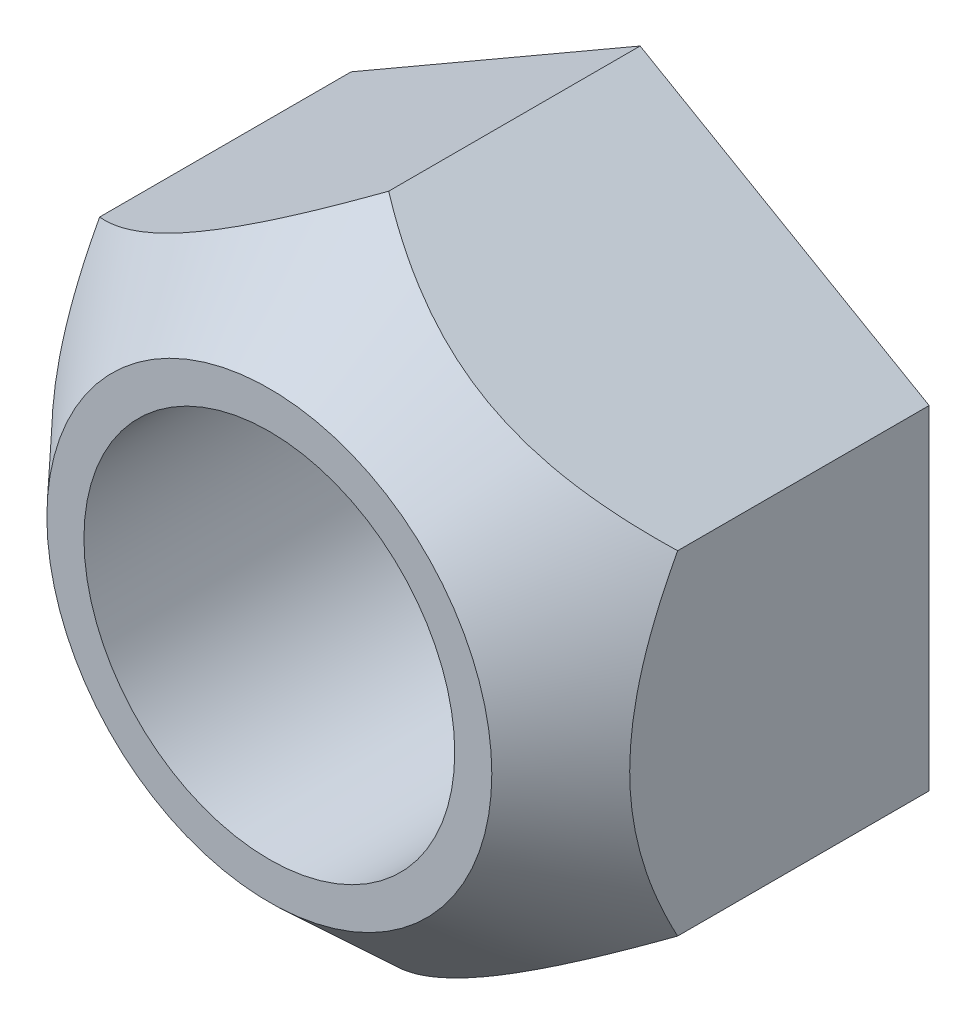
ISO-10303-21;
HEADER;
FILE_DESCRIPTION(('STEP AP214'),'2;1');
FILE_NAME('part.step','',(''),(''),'','','');
FILE_SCHEMA(('AUTOMOTIVE_DESIGN { 1 0 10303 214 1 1 1 1 }'));
ENDSEC;
DATA;
#1=APPLICATION_CONTEXT('core data for automotive mechanical design processes');
#2=APPLICATION_PROTOCOL_DEFINITION('international standard','automotive_design',2000,#1);
#3=PRODUCT_CONTEXT('',#1,'mechanical');
#4=PRODUCT('Part','Part','',(#3));
#5=PRODUCT_RELATED_PRODUCT_CATEGORY('part','',(#4));
#6=PRODUCT_DEFINITION_FORMATION('','',#4);
#7=PRODUCT_DEFINITION_CONTEXT('part definition',#1,'design');
#8=PRODUCT_DEFINITION('design','',#6,#7);
#9=PRODUCT_DEFINITION_SHAPE('','',#8);
#10=(LENGTH_UNIT() NAMED_UNIT(*) SI_UNIT(.MILLI.,.METRE.));
#11=(NAMED_UNIT(*) PLANE_ANGLE_UNIT() SI_UNIT($,.RADIAN.));
#12=(NAMED_UNIT(*) SI_UNIT($,.STERADIAN.) SOLID_ANGLE_UNIT());
#13=UNCERTAINTY_MEASURE_WITH_UNIT(LENGTH_MEASURE(1.E-05),#10,'distance_accuracy_value','');
#14=(GEOMETRIC_REPRESENTATION_CONTEXT(3) GLOBAL_UNCERTAINTY_ASSIGNED_CONTEXT((#13)) GLOBAL_UNIT_ASSIGNED_CONTEXT((#10,
#11,#12)) REPRESENTATION_CONTEXT('',''));
#15=CARTESIAN_POINT('',(0.,0.,0.));
#16=DIRECTION('',(0.,0.,1.));
#17=DIRECTION('',(1.,0.,0.));
#18=AXIS2_PLACEMENT_3D('',#15,#16,#17);
#19=CARTESIAN_POINT('',(-3.89711431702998,-2.25000000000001,-5.));
#20=DIRECTION('',(-0.5,-0.866025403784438,0.));
#21=DIRECTION('',(0.866025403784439,-0.5,0.));
#22=AXIS2_PLACEMENT_3D('',#19,#20,#21);
#23=PLANE('',#22);
#24=DIRECTION('',(0.,0.,1.));
#25=VECTOR('',#24,1.);
#26=CARTESIAN_POINT('',(0.,-4.5,-5.));
#27=LINE('',#26,#25);
#28=CARTESIAN_POINT('',(0.,-4.5,-5.));
#29=VERTEX_POINT('',#28);
#30=CARTESIAN_POINT('',(0.,-4.5,-1.60855306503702));
#31=VERTEX_POINT('',#30);
#32=EDGE_CURVE('E32',#29,#31,#27,.T.);
#33=ORIENTED_EDGE('',*,*,#32,.T.);
#34=CARTESIAN_POINT('',(0.000199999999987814,-4.50011547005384,-1.60867689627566));
#35=CARTESIAN_POINT('',(-0.0629287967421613,-4.46366804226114,-1.5695954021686));
#36=CARTESIAN_POINT('',(-0.1265655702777,-4.42692733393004,-1.53161049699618));
#37=CARTESIAN_POINT('',(-0.254961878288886,-4.35279769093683,-1.4581651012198));
#38=CARTESIAN_POINT('',(-0.319721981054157,-4.31540842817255,-1.42270593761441));
#39=CARTESIAN_POINT('',(-0.516487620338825,-4.20180573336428,-1.32028924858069));
#40=CARTESIAN_POINT('',(-0.650265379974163,-4.12456910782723,-1.2577432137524));
#41=CARTESIAN_POINT('',(-0.920543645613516,-3.96852387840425,-1.14878573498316));
#42=CARTESIAN_POINT('',(-1.05697565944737,-3.88975481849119,-1.10215157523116));
#43=CARTESIAN_POINT('',(-1.33339518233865,-3.73016393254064,-1.02762893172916));
#44=CARTESIAN_POINT('',(-1.47337255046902,-3.64934796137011,-0.9996921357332));
#45=CARTESIAN_POINT('',(-1.71070596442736,-3.51232345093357,-0.970711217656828));
#46=CARTESIAN_POINT('',(-1.80755347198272,-3.45640851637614,-0.963958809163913));
#47=CARTESIAN_POINT('',(-2.00141310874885,-3.34448360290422,-0.960828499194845));
#48=CARTESIAN_POINT('',(-2.0984252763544,-3.28847360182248,-0.964453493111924));
#49=CARTESIAN_POINT('',(-2.29184008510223,-3.17680550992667,-0.981898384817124));
#50=CARTESIAN_POINT('',(-2.38824205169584,-3.12114780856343,-0.995728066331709));
#51=CARTESIAN_POINT('',(-2.57964059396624,-3.01064380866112,-1.03285806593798));
#52=CARTESIAN_POINT('',(-2.67463727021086,-2.95579745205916,-1.05615770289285));
#53=CARTESIAN_POINT('',(-2.86728043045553,-2.84457487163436,-1.11248331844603));
#54=CARTESIAN_POINT('',(-2.96483528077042,-2.78825155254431,-1.14592242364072));
#55=CARTESIAN_POINT('',(-3.15768355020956,-2.67691055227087,-1.22068978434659));
#56=CARTESIAN_POINT('',(-3.25297569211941,-2.62189360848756,-1.26202238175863));
#57=CARTESIAN_POINT('',(-3.4411497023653,-2.5132512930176,-1.35121680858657));
#58=CARTESIAN_POINT('',(-3.53403288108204,-2.4596251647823,-1.39907499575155));
#59=CARTESIAN_POINT('',(-3.71739831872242,-2.35375908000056,-1.50013602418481));
#60=CARTESIAN_POINT('',(-3.80788455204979,-2.30151682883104,-1.55332921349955));
#61=CARTESIAN_POINT('',(-3.89731431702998,-2.24988452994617,-1.60867689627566));
#62=B_SPLINE_CURVE_WITH_KNOTS('',3,(#34,#35,#36,#37,#38,#39,#40,#41,#42,#43,#44,#45,#46,#47,#48,
#49,#50,#51,#52,#53,#54,#55,#56,#57,#58,#59,#60,#61),.UNSPECIFIED.,.F.,.F.,(4,2,2,2,2,2,2,2,2,2,
2,2,2,4),(0.,0.248113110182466,0.496355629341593,0.995650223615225,1.48763825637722,
1.97835007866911,2.31400450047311,2.64975258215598,2.98582298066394,3.32186921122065,
3.67404317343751,4.02641141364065,4.37858377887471,4.73013011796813),.UNSPECIFIED.);
#63=CARTESIAN_POINT('',(-3.89711431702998,-2.25000000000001,-1.60855306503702));
#64=VERTEX_POINT('',#63);
#65=EDGE_CURVE('E45',#31,#64,#62,.T.);
#66=ORIENTED_EDGE('',*,*,#65,.T.);
#67=DIRECTION('',(0.,0.,1.));
#68=VECTOR('',#67,1.);
#69=CARTESIAN_POINT('',(-3.89711431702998,-2.25000000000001,-5.));
#70=LINE('',#69,#68);
#71=CARTESIAN_POINT('',(-3.89711431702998,-2.25000000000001,-5.));
#72=VERTEX_POINT('',#71);
#73=EDGE_CURVE('E11',#72,#64,#70,.T.);
#74=ORIENTED_EDGE('',*,*,#73,.F.);
#75=DIRECTION('',(0.866025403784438,-0.5,0.));
#76=VECTOR('',#75,1.);
#77=CARTESIAN_POINT('',(-3.89711431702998,-2.25000000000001,-5.));
#78=LINE('',#77,#76);
#79=EDGE_CURVE('E122',#72,#29,#78,.T.);
#80=ORIENTED_EDGE('',*,*,#79,.T.);
#81=EDGE_LOOP('',(#33,#66,#74,#80));
#82=FACE_BOUND('',#81,.T.);
#83=ADVANCED_FACE('F28',(#82),#23,.T.);
#84=CARTESIAN_POINT('',(-3.89711431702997,2.25,-5.));
#85=DIRECTION('',(-1.,0.,0.));
#86=DIRECTION('',(0.,-1.,0.));
#87=AXIS2_PLACEMENT_3D('',#84,#85,#86);
#88=PLANE('',#87);
#89=ORIENTED_EDGE('',*,*,#73,.T.);
#90=CARTESIAN_POINT('',(-3.89711431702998,-5.21260992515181,-3.76225979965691));
#91=CARTESIAN_POINT('',(-3.89711431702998,-5.09064696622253,-3.65753177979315));
#92=CARTESIAN_POINT('',(-3.89711431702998,-4.96804870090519,-3.55353314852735));
#93=CARTESIAN_POINT('',(-3.89711431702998,-4.72129985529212,-3.34734277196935));
#94=CARTESIAN_POINT('',(-3.89711431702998,-4.59714895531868,-3.24515140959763));
#95=CARTESIAN_POINT('',(-3.89711431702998,-4.34609001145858,-3.04218041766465));
#96=CARTESIAN_POINT('',(-3.89711431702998,-4.21916802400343,-2.94141798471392));
#97=CARTESIAN_POINT('',(-3.89711431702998,-3.96318804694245,-2.74265578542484));
#98=CARTESIAN_POINT('',(-3.89711431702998,-3.83413020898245,-2.64465582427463));
#99=CARTESIAN_POINT('',(-3.89711431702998,-3.56329479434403,-2.4445727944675));
#100=CARTESIAN_POINT('',(-3.89711431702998,-3.4213106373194,-2.34276803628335));
#101=CARTESIAN_POINT('',(-3.89711431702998,-3.13374233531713,-2.14427870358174));
#102=CARTESIAN_POINT('',(-3.89711431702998,-2.98815745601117,-2.04759518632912));
#103=CARTESIAN_POINT('',(-3.89711431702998,-2.69316188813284,-1.86126461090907));
#104=CARTESIAN_POINT('',(-3.89711431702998,-2.54376468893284,-1.7715963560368));
#105=CARTESIAN_POINT('',(-3.89711431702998,-2.2399950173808,-1.60119859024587));
#106=CARTESIAN_POINT('',(-3.89711431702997,-2.08562532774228,-1.52046418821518));
#107=CARTESIAN_POINT('',(-3.89711431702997,-1.79851600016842,-1.38392161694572));
#108=CARTESIAN_POINT('',(-3.89711431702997,-1.66668449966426,-1.3262204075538));
#109=CARTESIAN_POINT('',(-3.89711431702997,-1.39889230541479,-1.22111213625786));
#110=CARTESIAN_POINT('',(-3.89711431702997,-1.2629309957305,-1.17370661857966));
#111=CARTESIAN_POINT('',(-3.89711431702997,-0.989539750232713,-1.0923967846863));
#112=CARTESIAN_POINT('',(-3.89711431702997,-0.852176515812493,-1.05827193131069));
#113=CARTESIAN_POINT('',(-3.89711431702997,-0.574610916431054,-1.00469116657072));
#114=CARTESIAN_POINT('',(-3.89711431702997,-0.434410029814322,-0.98522780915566));
#115=CARTESIAN_POINT('',(-3.89711431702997,-0.182530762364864,-0.964929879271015));
#116=CARTESIAN_POINT('',(-3.89711431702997,-0.0710949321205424,-0.961024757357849));
#117=CARTESIAN_POINT('',(-3.89711431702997,0.151653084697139,-0.963496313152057));
#118=CARTESIAN_POINT('',(-3.89711431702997,0.262965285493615,-0.969871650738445));
#119=CARTESIAN_POINT('',(-3.89711431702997,0.484978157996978,-0.99259863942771));
#120=CARTESIAN_POINT('',(-3.89711431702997,0.595674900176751,-1.00898809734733));
#121=CARTESIAN_POINT('',(-3.89711431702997,0.815311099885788,-1.05094016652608));
#122=CARTESIAN_POINT('',(-3.89711431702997,0.924250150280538,-1.07650487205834));
#123=CARTESIAN_POINT('',(-3.89711431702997,1.190445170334,-1.14958489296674));
#124=CARTESIAN_POINT('',(-3.89711431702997,1.34641756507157,-1.20177248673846));
#125=CARTESIAN_POINT('',(-3.89711431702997,1.65305814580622,-1.31985773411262));
#126=CARTESIAN_POINT('',(-3.89711431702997,1.80372272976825,-1.3857644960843));
#127=CARTESIAN_POINT('',(-3.89711431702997,2.10171060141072,-1.52886495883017));
#128=CARTESIAN_POINT('',(-3.89711431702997,2.24897414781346,-1.60618172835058));
#129=CARTESIAN_POINT('',(-3.89711431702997,2.46637771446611,-1.72821395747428));
#130=CARTESIAN_POINT('',(-3.89711431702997,2.53825354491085,-1.76989446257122));
#131=CARTESIAN_POINT('',(-3.89711431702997,2.68094249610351,-1.85503230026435));
#132=CARTESIAN_POINT('',(-3.89711431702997,2.75175566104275,-1.89848955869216));
#133=CARTESIAN_POINT('',(-3.89711431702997,2.97889443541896,-2.0413446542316));
#134=CARTESIAN_POINT('',(-3.89711431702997,3.13328957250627,-2.14381582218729));
#135=CARTESIAN_POINT('',(-3.89711431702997,3.43811147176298,-2.35452302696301));
#136=CARTESIAN_POINT('',(-3.89711431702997,3.58853720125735,-2.46276054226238));
#137=CARTESIAN_POINT('',(-3.89711431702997,3.88624750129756,-2.68373576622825));
#138=CARTESIAN_POINT('',(-3.89711431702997,4.03352907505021,-2.79647749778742));
#139=CARTESIAN_POINT('',(-3.89711431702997,4.32537884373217,-3.02537941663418));
#140=CARTESIAN_POINT('',(-3.89711431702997,4.46994728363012,-3.14153929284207));
#141=CARTESIAN_POINT('',(-3.89711431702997,4.75745725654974,-3.37706841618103));
#142=CARTESIAN_POINT('',(-3.89711431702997,4.90038939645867,-3.49644910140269));
#143=CARTESIAN_POINT('',(-3.89711431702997,5.18438275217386,-3.73741844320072));
#144=CARTESIAN_POINT('',(-3.89711431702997,5.32544391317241,-3.8590071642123));
#145=CARTESIAN_POINT('',(-3.89711431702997,5.74614216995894,-4.22632254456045));
#146=CARTESIAN_POINT('',(-3.89711431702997,6.02344419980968,-4.47472294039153));
#147=CARTESIAN_POINT('',(-3.89711431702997,6.54376688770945,-4.94923781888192));
#148=CARTESIAN_POINT('',(-3.89711431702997,6.7872471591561,-5.17485165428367));
#149=CARTESIAN_POINT('',(-3.89711431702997,7.27150515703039,-5.62902599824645));
#150=CARTESIAN_POINT('',(-3.89711431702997,7.51228250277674,-5.85758691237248));
#151=CARTESIAN_POINT('',(-3.89711431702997,7.98963345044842,-6.31493820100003));
#152=CARTESIAN_POINT('',(-3.89711431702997,8.22622539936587,-6.54370946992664));
#153=CARTESIAN_POINT('',(-3.89711431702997,8.69767558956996,-7.00294130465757));
#154=CARTESIAN_POINT('',(-3.89711431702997,8.93253415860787,-7.23340153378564));
#155=CARTESIAN_POINT('',(-3.89711431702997,9.1667512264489,-7.46450597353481));
#156=B_SPLINE_CURVE_WITH_KNOTS('',3,(#90,#91,#92,#93,#94,#95,#96,#97,#98,#99,#100,#101,#102,
#103,#104,#105,#106,#107,#108,#109,#110,#111,#112,#113,#114,#115,#116,#117,#118,#119,#120,#121,
#122,#123,#124,#125,#126,#127,#128,#129,#130,#131,#132,#133,#134,#135,#136,#137,#138,#139,#140,
#141,#142,#143,#144,#145,#146,#147,#148,#149,#150,#151,#152,#153,#154,#155),.UNSPECIFIED.,.F.,
.F.,(4,2,2,2,2,2,2,2,2,2,2,2,2,2,2,2,2,2,2,2,2,2,2,2,2,2,2,2,2,2,2,2,4),(0.,0.482279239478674,
0.964659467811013,1.45079708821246,1.93690033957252,2.46094397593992,2.98509538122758,
3.5075964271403,4.02980998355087,4.4611898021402,4.89263427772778,5.31657275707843,
5.740295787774,6.0743524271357,6.40836552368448,6.74364749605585,7.07900604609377,
7.57153479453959,8.06439158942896,8.56301650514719,8.81225742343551,9.06148794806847,
9.61720889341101,10.1730730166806,10.7294452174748,11.2857669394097,11.8444271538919,
12.4031036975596,13.51987176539,14.5156672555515,15.5116012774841,16.4989158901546,
17.4860387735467),.UNSPECIFIED.);
#157=CARTESIAN_POINT('',(-3.89711431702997,2.25,-1.60855306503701));
#158=VERTEX_POINT('',#157);
#159=EDGE_CURVE('E135',#64,#158,#156,.T.);
#160=ORIENTED_EDGE('',*,*,#159,.T.);
#161=DIRECTION('',(0.,0.,1.));
#162=VECTOR('',#161,1.);
#163=CARTESIAN_POINT('',(-3.89711431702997,2.25,-5.));
#164=LINE('',#163,#162);
#165=CARTESIAN_POINT('',(-3.89711431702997,2.25,-5.));
#166=VERTEX_POINT('',#165);
#167=EDGE_CURVE('E37',#166,#158,#164,.T.);
#168=ORIENTED_EDGE('',*,*,#167,.F.);
#169=DIRECTION('',(0.,-1.,0.));
#170=VECTOR('',#169,1.);
#171=CARTESIAN_POINT('',(-3.89711431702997,2.25,-5.));
#172=LINE('',#171,#170);
#173=EDGE_CURVE('E105',#166,#72,#172,.T.);
#174=ORIENTED_EDGE('',*,*,#173,.T.);
#175=EDGE_LOOP('',(#89,#160,#168,#174));
#176=FACE_BOUND('',#175,.T.);
#177=ADVANCED_FACE('F174',(#176),#88,.T.);
#178=CARTESIAN_POINT('',(0.,4.5,-5.));
#179=DIRECTION('',(-0.500000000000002,0.866025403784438,0.));
#180=DIRECTION('',(-0.866025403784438,-0.500000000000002,0.));
#181=AXIS2_PLACEMENT_3D('',#178,#179,#180);
#182=PLANE('',#181);
#183=ORIENTED_EDGE('',*,*,#167,.T.);
#184=CARTESIAN_POINT('',(-3.89731431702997,2.24988452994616,-1.60867689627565));
#185=CARTESIAN_POINT('',(-3.83418552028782,2.28633195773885,-1.56959540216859));
#186=CARTESIAN_POINT('',(-3.77054874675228,2.32307266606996,-1.53161049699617));
#187=CARTESIAN_POINT('',(-3.6421524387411,2.39720230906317,-1.45816510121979));
#188=CARTESIAN_POINT('',(-3.57739233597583,2.43459157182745,-1.4227059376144));
#189=CARTESIAN_POINT('',(-3.38062669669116,2.54819426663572,-1.32028924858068));
#190=CARTESIAN_POINT('',(-3.24684893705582,2.62543089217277,-1.25774321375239));
#191=CARTESIAN_POINT('',(-2.97657067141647,2.78147612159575,-1.14878573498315));
#192=CARTESIAN_POINT('',(-2.84013865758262,2.86024518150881,-1.10215157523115));
#193=CARTESIAN_POINT('',(-2.56371913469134,3.01983606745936,-1.02762893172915));
#194=CARTESIAN_POINT('',(-2.42374176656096,3.10065203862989,-0.99969213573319));
#195=CARTESIAN_POINT('',(-2.18640835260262,3.23767654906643,-0.970711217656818));
#196=CARTESIAN_POINT('',(-2.08956084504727,3.29359148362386,-0.963958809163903));
#197=CARTESIAN_POINT('',(-1.89570120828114,3.40551639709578,-0.960828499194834));
#198=CARTESIAN_POINT('',(-1.79868904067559,3.46152639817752,-0.964453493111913));
#199=CARTESIAN_POINT('',(-1.60527423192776,3.57319449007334,-0.981898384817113));
#200=CARTESIAN_POINT('',(-1.50887226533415,3.62885219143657,-0.995728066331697));
#201=CARTESIAN_POINT('',(-1.31747372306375,3.73935619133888,-1.03285806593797));
#202=CARTESIAN_POINT('',(-1.22247704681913,3.79420254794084,-1.05615770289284));
#203=CARTESIAN_POINT('',(-1.02983388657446,3.90542512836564,-1.11248331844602));
#204=CARTESIAN_POINT('',(-0.932279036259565,3.9617484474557,-1.14592242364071));
#205=CARTESIAN_POINT('',(-0.739430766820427,4.07308944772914,-1.22068978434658));
#206=CARTESIAN_POINT('',(-0.644138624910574,4.12810639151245,-1.26202238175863));
#207=CARTESIAN_POINT('',(-0.455964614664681,4.23674870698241,-1.35121680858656));
#208=CARTESIAN_POINT('',(-0.363081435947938,4.29037483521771,-1.39907499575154));
#209=CARTESIAN_POINT('',(-0.179715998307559,4.39624091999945,-1.50013602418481));
#210=CARTESIAN_POINT('',(-0.0892297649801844,4.44848317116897,-1.55332921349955));
#211=CARTESIAN_POINT('',(0.000199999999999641,4.50011547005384,-1.60867689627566));
#212=B_SPLINE_CURVE_WITH_KNOTS('',3,(#184,#185,#186,#187,#188,#189,#190,#191,#192,#193,#194,
#195,#196,#197,#198,#199,#200,#201,#202,#203,#204,#205,#206,#207,#208,#209,#210,#211),
.UNSPECIFIED.,.F.,.F.,(4,2,2,2,2,2,2,2,2,2,2,2,2,4),(0.,0.248113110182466,0.496355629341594,
0.995650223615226,1.48763825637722,1.97835007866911,2.31400450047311,2.64975258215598,
2.98582298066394,3.32186921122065,3.67404317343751,4.02641141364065,4.37858377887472,
4.73013011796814),.UNSPECIFIED.);
#213=CARTESIAN_POINT('',(0.,4.5,-1.60855306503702));
#214=VERTEX_POINT('',#213);
#215=EDGE_CURVE('E164',#158,#214,#212,.T.);
#216=ORIENTED_EDGE('',*,*,#215,.T.);
#217=DIRECTION('',(0.,0.,1.));
#218=VECTOR('',#217,1.);
#219=CARTESIAN_POINT('',(0.,4.5,-5.));
#220=LINE('',#219,#218);
#221=CARTESIAN_POINT('',(0.,4.5,-5.));
#222=VERTEX_POINT('',#221);
#223=EDGE_CURVE('E103',#222,#214,#220,.T.);
#224=ORIENTED_EDGE('',*,*,#223,.F.);
#225=DIRECTION('',(-0.866025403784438,-0.500000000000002,0.));
#226=VECTOR('',#225,1.);
#227=CARTESIAN_POINT('',(0.,4.5,-5.));
#228=LINE('',#227,#226);
#229=EDGE_CURVE('E113',#222,#166,#228,.T.);
#230=ORIENTED_EDGE('',*,*,#229,.T.);
#231=EDGE_LOOP('',(#183,#216,#224,#230));
#232=FACE_BOUND('',#231,.T.);
#233=ADVANCED_FACE('F170',(#232),#182,.T.);
#234=CARTESIAN_POINT('',(3.89711431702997,2.25,-5.));
#235=DIRECTION('',(0.500000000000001,0.866025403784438,0.));
#236=DIRECTION('',(-0.866025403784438,0.500000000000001,0.));
#237=AXIS2_PLACEMENT_3D('',#234,#235,#236);
#238=PLANE('',#237);
#239=ORIENTED_EDGE('',*,*,#223,.T.);
#240=CARTESIAN_POINT('',(-0.000200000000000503,4.50011547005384,-1.60867689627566));
#241=CARTESIAN_POINT('',(0.062928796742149,4.46366804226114,-1.5695954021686));
#242=CARTESIAN_POINT('',(0.126565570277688,4.42692733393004,-1.53161049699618));
#243=CARTESIAN_POINT('',(0.254961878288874,4.35279769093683,-1.4581651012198));
#244=CARTESIAN_POINT('',(0.319721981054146,4.31540842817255,-1.42270593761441));
#245=CARTESIAN_POINT('',(0.516487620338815,4.20180573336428,-1.32028924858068));
#246=CARTESIAN_POINT('',(0.650265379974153,4.12456910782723,-1.2577432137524));
#247=CARTESIAN_POINT('',(0.920543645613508,3.96852387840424,-1.14878573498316));
#248=CARTESIAN_POINT('',(1.05697565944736,3.88975481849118,-1.10215157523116));
#249=CARTESIAN_POINT('',(1.33339518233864,3.73016393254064,-1.02762893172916));
#250=CARTESIAN_POINT('',(1.47337255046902,3.64934796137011,-0.999692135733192));
#251=CARTESIAN_POINT('',(1.71070596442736,3.51232345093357,-0.970711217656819));
#252=CARTESIAN_POINT('',(1.80755347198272,3.45640851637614,-0.963958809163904));
#253=CARTESIAN_POINT('',(2.00141310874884,3.34448360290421,-0.960828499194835));
#254=CARTESIAN_POINT('',(2.0984252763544,3.28847360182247,-0.964453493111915));
#255=CARTESIAN_POINT('',(2.29184008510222,3.17680550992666,-0.981898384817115));
#256=CARTESIAN_POINT('',(2.38824205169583,3.12114780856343,-0.995728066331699));
#257=CARTESIAN_POINT('',(2.57964059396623,3.01064380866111,-1.03285806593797));
#258=CARTESIAN_POINT('',(2.67463727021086,2.95579745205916,-1.05615770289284));
#259=CARTESIAN_POINT('',(2.86728043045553,2.84457487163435,-1.11248331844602));
#260=CARTESIAN_POINT('',(2.96483528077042,2.7882515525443,-1.14592242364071));
#261=CARTESIAN_POINT('',(3.15768355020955,2.67691055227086,-1.22068978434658));
#262=CARTESIAN_POINT('',(3.25297569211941,2.62189360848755,-1.26202238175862));
#263=CARTESIAN_POINT('',(3.4411497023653,2.51325129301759,-1.35121680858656));
#264=CARTESIAN_POINT('',(3.53403288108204,2.45962516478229,-1.39907499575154));
#265=CARTESIAN_POINT('',(3.71739831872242,2.35375908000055,-1.5001360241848));
#266=CARTESIAN_POINT('',(3.80788455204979,2.30151682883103,-1.55332921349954));
#267=CARTESIAN_POINT('',(3.89731431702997,2.24988452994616,-1.60867689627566));
#268=B_SPLINE_CURVE_WITH_KNOTS('',3,(#240,#241,#242,#243,#244,#245,#246,#247,#248,#249,#250,
#251,#252,#253,#254,#255,#256,#257,#258,#259,#260,#261,#262,#263,#264,#265,#266,#267),
.UNSPECIFIED.,.F.,.F.,(4,2,2,2,2,2,2,2,2,2,2,2,2,4),(0.,0.248113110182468,0.496355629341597,
0.995650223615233,1.48763825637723,1.97835007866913,2.31400450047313,2.64975258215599,
2.98582298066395,3.32186921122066,3.67404317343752,4.02641141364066,4.37858377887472,
4.73013011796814),.UNSPECIFIED.);
#269=CARTESIAN_POINT('',(3.89711431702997,2.25,-1.60855306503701));
#270=VERTEX_POINT('',#269);
#271=EDGE_CURVE('E97',#214,#270,#268,.T.);
#272=ORIENTED_EDGE('',*,*,#271,.T.);
#273=DIRECTION('',(0.,0.,1.));
#274=VECTOR('',#273,1.);
#275=CARTESIAN_POINT('',(3.89711431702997,2.25,-5.));
#276=LINE('',#275,#274);
#277=CARTESIAN_POINT('',(3.89711431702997,2.25,-5.));
#278=VERTEX_POINT('',#277);
#279=EDGE_CURVE('E96',#278,#270,#276,.T.);
#280=ORIENTED_EDGE('',*,*,#279,.F.);
#281=DIRECTION('',(-0.866025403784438,0.500000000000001,0.));
#282=VECTOR('',#281,1.);
#283=CARTESIAN_POINT('',(3.89711431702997,2.25,-5.));
#284=LINE('',#283,#282);
#285=EDGE_CURVE('E116',#278,#222,#284,.T.);
#286=ORIENTED_EDGE('',*,*,#285,.T.);
#287=EDGE_LOOP('',(#239,#272,#280,#286));
#288=FACE_BOUND('',#287,.T.);
#289=ADVANCED_FACE('F173',(#288),#238,.T.);
#290=CARTESIAN_POINT('',(3.89711431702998,-2.25,-5.));
#291=DIRECTION('',(1.,0.,0.));
#292=DIRECTION('',(0.,1.,0.));
#293=AXIS2_PLACEMENT_3D('',#290,#291,#292);
#294=PLANE('',#293);
#295=ORIENTED_EDGE('',*,*,#279,.T.);
#296=CARTESIAN_POINT('',(3.89711431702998,-5.21260992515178,-3.76225979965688));
#297=CARTESIAN_POINT('',(3.89711431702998,-5.0906469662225,-3.65753177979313));
#298=CARTESIAN_POINT('',(3.89711431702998,-4.96804870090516,-3.55353314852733));
#299=CARTESIAN_POINT('',(3.89711431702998,-4.7212998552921,-3.34734277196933));
#300=CARTESIAN_POINT('',(3.89711431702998,-4.59714895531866,-3.24515140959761));
#301=CARTESIAN_POINT('',(3.89711431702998,-4.34609001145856,-3.04218041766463));
#302=CARTESIAN_POINT('',(3.89711431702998,-4.21916802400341,-2.9414179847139));
#303=CARTESIAN_POINT('',(3.89711431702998,-3.96318804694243,-2.74265578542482));
#304=CARTESIAN_POINT('',(3.89711431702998,-3.83413020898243,-2.64465582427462));
#305=CARTESIAN_POINT('',(3.89711431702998,-3.56329479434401,-2.44457279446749));
#306=CARTESIAN_POINT('',(3.89711431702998,-3.42131063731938,-2.34276803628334));
#307=CARTESIAN_POINT('',(3.89711431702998,-3.13374233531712,-2.14427870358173));
#308=CARTESIAN_POINT('',(3.89711431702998,-2.98815745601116,-2.04759518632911));
#309=CARTESIAN_POINT('',(3.89711431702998,-2.69316188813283,-1.86126461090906));
#310=CARTESIAN_POINT('',(3.89711431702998,-2.54376468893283,-1.77159635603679));
#311=CARTESIAN_POINT('',(3.89711431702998,-2.23999501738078,-1.60119859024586));
#312=CARTESIAN_POINT('',(3.89711431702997,-2.08562532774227,-1.52046418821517));
#313=CARTESIAN_POINT('',(3.89711431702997,-1.79851600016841,-1.38392161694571));
#314=CARTESIAN_POINT('',(3.89711431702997,-1.66668449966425,-1.3262204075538));
#315=CARTESIAN_POINT('',(3.89711431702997,-1.39889230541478,-1.22111213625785));
#316=CARTESIAN_POINT('',(3.89711431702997,-1.26293099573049,-1.17370661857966));
#317=CARTESIAN_POINT('',(3.89711431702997,-0.989539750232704,-1.0923967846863));
#318=CARTESIAN_POINT('',(3.89711431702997,-0.852176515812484,-1.05827193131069));
#319=CARTESIAN_POINT('',(3.89711431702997,-0.574610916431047,-1.00469116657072));
#320=CARTESIAN_POINT('',(3.89711431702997,-0.434410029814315,-0.98522780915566));
#321=CARTESIAN_POINT('',(3.89711431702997,-0.182530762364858,-0.964929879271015));
#322=CARTESIAN_POINT('',(3.89711431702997,-0.0710949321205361,-0.961024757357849));
#323=CARTESIAN_POINT('',(3.89711431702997,0.151653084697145,-0.963496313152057));
#324=CARTESIAN_POINT('',(3.89711431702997,0.262965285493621,-0.969871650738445));
#325=CARTESIAN_POINT('',(3.89711431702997,0.484978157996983,-0.99259863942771));
#326=CARTESIAN_POINT('',(3.89711431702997,0.595674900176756,-1.00898809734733));
#327=CARTESIAN_POINT('',(3.89711431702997,0.815311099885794,-1.05094016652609));
#328=CARTESIAN_POINT('',(3.89711431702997,0.924250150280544,-1.07650487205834));
#329=CARTESIAN_POINT('',(3.89711431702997,1.19044517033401,-1.14958489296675));
#330=CARTESIAN_POINT('',(3.89711431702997,1.34641756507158,-1.20177248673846));
#331=CARTESIAN_POINT('',(3.89711431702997,1.65305814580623,-1.31985773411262));
#332=CARTESIAN_POINT('',(3.89711431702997,1.80372272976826,-1.3857644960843));
#333=CARTESIAN_POINT('',(3.89711431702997,2.10171060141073,-1.52886495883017));
#334=CARTESIAN_POINT('',(3.89711431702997,2.24897414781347,-1.60618172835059));
#335=CARTESIAN_POINT('',(3.89711431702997,2.46637771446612,-1.72821395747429));
#336=CARTESIAN_POINT('',(3.89711431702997,2.53825354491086,-1.76989446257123));
#337=CARTESIAN_POINT('',(3.89711431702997,2.68094249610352,-1.85503230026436));
#338=CARTESIAN_POINT('',(3.89711431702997,2.75175566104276,-1.89848955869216));
#339=CARTESIAN_POINT('',(3.89711431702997,2.97889443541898,-2.04134465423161));
#340=CARTESIAN_POINT('',(3.89711431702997,3.13328957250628,-2.14381582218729));
#341=CARTESIAN_POINT('',(3.89711431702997,3.438111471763,-2.35452302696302));
#342=CARTESIAN_POINT('',(3.89711431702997,3.58853720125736,-2.46276054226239));
#343=CARTESIAN_POINT('',(3.89711431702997,3.88624750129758,-2.68373576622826));
#344=CARTESIAN_POINT('',(3.89711431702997,4.03352907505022,-2.79647749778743));
#345=CARTESIAN_POINT('',(3.89711431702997,4.32537884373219,-3.02537941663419));
#346=CARTESIAN_POINT('',(3.89711431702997,4.46994728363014,-3.14153929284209));
#347=CARTESIAN_POINT('',(3.89711431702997,4.75745725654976,-3.37706841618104));
#348=CARTESIAN_POINT('',(3.89711431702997,4.9003893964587,-3.49644910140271));
#349=CARTESIAN_POINT('',(3.89711431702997,5.18438275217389,-3.73741844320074));
#350=CARTESIAN_POINT('',(3.89711431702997,5.32544391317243,-3.85900716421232));
#351=CARTESIAN_POINT('',(3.89711431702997,5.74614216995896,-4.22632254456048));
#352=CARTESIAN_POINT('',(3.89711431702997,6.0234441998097,-4.47472294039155));
#353=CARTESIAN_POINT('',(3.89711431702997,6.54376688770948,-4.94923781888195));
#354=CARTESIAN_POINT('',(3.89711431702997,6.78724715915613,-5.1748516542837));
#355=CARTESIAN_POINT('',(3.89711431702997,7.27150515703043,-5.62902599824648));
#356=CARTESIAN_POINT('',(3.89711431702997,7.51228250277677,-5.85758691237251));
#357=CARTESIAN_POINT('',(3.89711431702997,7.98963345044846,-6.31493820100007));
#358=CARTESIAN_POINT('',(3.89711431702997,8.22622539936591,-6.54370946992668));
#359=CARTESIAN_POINT('',(3.89711431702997,8.69767558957,-7.00294130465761));
#360=CARTESIAN_POINT('',(3.89711431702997,8.93253415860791,-7.23340153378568));
#361=CARTESIAN_POINT('',(3.89711431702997,9.16675122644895,-7.46450597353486));
#362=B_SPLINE_CURVE_WITH_KNOTS('',3,(#296,#297,#298,#299,#300,#301,#302,#303,#304,#305,#306,
#307,#308,#309,#310,#311,#312,#313,#314,#315,#316,#317,#318,#319,#320,#321,#322,#323,#324,#325,
#326,#327,#328,#329,#330,#331,#332,#333,#334,#335,#336,#337,#338,#339,#340,#341,#342,#343,#344,
#345,#346,#347,#348,#349,#350,#351,#352,#353,#354,#355,#356,#357,#358,#359,#360,#361),
.UNSPECIFIED.,.F.,.F.,(4,2,2,2,2,2,2,2,2,2,2,2,2,2,2,2,2,2,2,2,2,2,2,2,2,2,2,2,2,2,2,2,4),(0.,
0.48227923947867,0.964659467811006,1.45079708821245,1.9369003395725,2.46094397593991,
2.98509538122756,3.50759642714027,4.02980998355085,4.46118980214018,4.89263427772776,
5.31657275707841,5.74029578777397,6.07435242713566,6.40836552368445,6.74364749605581,
7.07900604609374,7.57153479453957,8.06439158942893,8.56301650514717,8.81225742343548,
9.06148794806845,9.61720889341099,10.1730730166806,10.7294452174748,11.2857669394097,
11.8444271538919,12.4031036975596,13.51987176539,14.5156672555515,15.5116012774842,
16.4989158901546,17.4860387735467),.UNSPECIFIED.);
#363=CARTESIAN_POINT('',(3.89711431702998,-2.24999999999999,-1.60855306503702));
#364=VERTEX_POINT('',#363);
#365=EDGE_CURVE('E83',#270,#364,#362,.F.);
#366=ORIENTED_EDGE('',*,*,#365,.T.);
#367=DIRECTION('',(0.,0.,1.));
#368=VECTOR('',#367,1.);
#369=CARTESIAN_POINT('',(3.89711431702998,-2.25,-5.));
#370=LINE('',#369,#368);
#371=CARTESIAN_POINT('',(3.89711431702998,-2.25,-5.));
#372=VERTEX_POINT('',#371);
#373=EDGE_CURVE('E94',#372,#364,#370,.T.);
#374=ORIENTED_EDGE('',*,*,#373,.F.);
#375=DIRECTION('',(0.,1.,0.));
#376=VECTOR('',#375,1.);
#377=CARTESIAN_POINT('',(3.89711431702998,-2.25,-5.));
#378=LINE('',#377,#376);
#379=EDGE_CURVE('E119',#372,#278,#378,.T.);
#380=ORIENTED_EDGE('',*,*,#379,.T.);
#381=EDGE_LOOP('',(#295,#366,#374,#380));
#382=FACE_BOUND('',#381,.T.);
#383=ADVANCED_FACE('F92',(#382),#294,.T.);
#384=CARTESIAN_POINT('',(0.,-4.5,-5.));
#385=DIRECTION('',(0.5,-0.866025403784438,0.));
#386=DIRECTION('',(0.866025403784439,0.5,0.));
#387=AXIS2_PLACEMENT_3D('',#384,#385,#386);
#388=PLANE('',#387);
#389=ORIENTED_EDGE('',*,*,#373,.T.);
#390=CARTESIAN_POINT('',(3.89731431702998,-2.24988452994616,-1.60867689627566));
#391=CARTESIAN_POINT('',(3.83418552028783,-2.28633195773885,-1.56959540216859));
#392=CARTESIAN_POINT('',(3.77054874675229,-2.32307266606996,-1.53161049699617));
#393=CARTESIAN_POINT('',(3.6421524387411,-2.39720230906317,-1.45816510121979));
#394=CARTESIAN_POINT('',(3.57739233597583,-2.43459157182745,-1.4227059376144));
#395=CARTESIAN_POINT('',(3.38062669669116,-2.54819426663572,-1.32028924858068));
#396=CARTESIAN_POINT('',(3.24684893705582,-2.62543089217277,-1.25774321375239));
#397=CARTESIAN_POINT('',(2.97657067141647,-2.78147612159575,-1.14878573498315));
#398=CARTESIAN_POINT('',(2.84013865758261,-2.86024518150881,-1.10215157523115));
#399=CARTESIAN_POINT('',(2.56371913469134,-3.01983606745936,-1.02762893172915));
#400=CARTESIAN_POINT('',(2.42374176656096,-3.10065203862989,-0.999692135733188));
#401=CARTESIAN_POINT('',(2.18640835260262,-3.23767654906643,-0.970711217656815));
#402=CARTESIAN_POINT('',(2.08956084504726,-3.29359148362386,-0.9639588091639));
#403=CARTESIAN_POINT('',(1.89570120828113,-3.40551639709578,-0.960828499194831));
#404=CARTESIAN_POINT('',(1.79868904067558,-3.46152639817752,-0.964453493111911));
#405=CARTESIAN_POINT('',(1.60527423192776,-3.57319449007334,-0.981898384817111));
#406=CARTESIAN_POINT('',(1.50887226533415,-3.62885219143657,-0.995728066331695));
#407=CARTESIAN_POINT('',(1.31747372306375,-3.73935619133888,-1.03285806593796));
#408=CARTESIAN_POINT('',(1.22247704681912,-3.79420254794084,-1.05615770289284));
#409=CARTESIAN_POINT('',(1.02983388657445,-3.90542512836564,-1.11248331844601));
#410=CARTESIAN_POINT('',(0.932279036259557,-3.9617484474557,-1.1459224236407));
#411=CARTESIAN_POINT('',(0.739430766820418,-4.07308944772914,-1.22068978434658));
#412=CARTESIAN_POINT('',(0.644138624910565,-4.12810639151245,-1.26202238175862));
#413=CARTESIAN_POINT('',(0.455964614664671,-4.23674870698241,-1.35121680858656));
#414=CARTESIAN_POINT('',(0.363081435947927,-4.2903748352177,-1.39907499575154));
#415=CARTESIAN_POINT('',(0.179715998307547,-4.39624091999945,-1.50013602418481));
#416=CARTESIAN_POINT('',(0.0892297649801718,-4.44848317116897,-1.55332921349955));
#417=CARTESIAN_POINT('',(-0.000200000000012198,-4.50011547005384,-1.60867689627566));
#418=B_SPLINE_CURVE_WITH_KNOTS('',3,(#390,#391,#392,#393,#394,#395,#396,#397,#398,#399,#400,
#401,#402,#403,#404,#405,#406,#407,#408,#409,#410,#411,#412,#413,#414,#415,#416,#417),
.UNSPECIFIED.,.F.,.F.,(4,2,2,2,2,2,2,2,2,2,2,2,2,4),(0.,0.248113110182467,0.496355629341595,
0.99565022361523,1.48763825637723,1.97835007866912,2.31400450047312,2.64975258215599,
2.98582298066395,3.32186921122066,3.67404317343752,4.02641141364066,4.37858377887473,
4.73013011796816),.UNSPECIFIED.);
#419=EDGE_CURVE('E79',#364,#31,#418,.T.);
#420=ORIENTED_EDGE('',*,*,#419,.T.);
#421=ORIENTED_EDGE('',*,*,#32,.F.);
#422=DIRECTION('',(0.866025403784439,0.5,0.));
#423=VECTOR('',#422,1.);
#424=CARTESIAN_POINT('',(0.,-4.5,-5.));
#425=LINE('',#424,#423);
#426=EDGE_CURVE('E102',#29,#372,#425,.T.);
#427=ORIENTED_EDGE('',*,*,#426,.T.);
#428=EDGE_LOOP('',(#389,#420,#421,#427));
#429=FACE_BOUND('',#428,.T.);
#430=ADVANCED_FACE('F100',(#429),#388,.T.);
#431=CARTESIAN_POINT('',(-7.79422863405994,0.,0.));
#432=DIRECTION('',(0.,0.,-1.));
#433=DIRECTION('',(-1.,0.,0.));
#434=AXIS2_PLACEMENT_3D('',#431,#432,#433);
#435=PLANE('',#434);
#436=CARTESIAN_POINT('',(0.,0.,0.));
#437=DIRECTION('',(0.,0.,1.));
#438=DIRECTION('',(1.,0.,0.));
#439=AXIS2_PLACEMENT_3D('',#436,#437,#438);
#440=CIRCLE('',#439,2.5);
#441=CARTESIAN_POINT('',(2.5,0.,0.));
#442=VERTEX_POINT('',#441);
#443=EDGE_CURVE('E127',#442,#442,#440,.T.);
#444=ORIENTED_EDGE('',*,*,#443,.F.);
#445=EDGE_LOOP('',(#444));
#446=FACE_BOUND('',#445,.T.);
#447=CARTESIAN_POINT('',(0.,0.,0.));
#448=DIRECTION('',(0.,0.,1.));
#449=DIRECTION('',(1.,0.,0.));
#450=AXIS2_PLACEMENT_3D('',#447,#448,#449);
#451=CIRCLE('',#450,3.);
#452=CARTESIAN_POINT('',(3.,0.,0.));
#453=VERTEX_POINT('',#452);
#454=EDGE_CURVE('E88',#453,#453,#451,.T.);
#455=ORIENTED_EDGE('',*,*,#454,.T.);
#456=EDGE_LOOP('',(#455));
#457=FACE_BOUND('',#456,.T.);
#458=ADVANCED_FACE('F185',(#446,#457),#435,.F.);
#459=CARTESIAN_POINT('',(-7.79422863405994,0.,-5.));
#460=DIRECTION('',(0.,0.,-1.));
#461=DIRECTION('',(-1.,0.,0.));
#462=AXIS2_PLACEMENT_3D('',#459,#460,#461);
#463=PLANE('',#462);
#464=CARTESIAN_POINT('',(0.,0.,-5.));
#465=DIRECTION('',(0.,0.,1.));
#466=DIRECTION('',(1.,0.,0.));
#467=AXIS2_PLACEMENT_3D('',#464,#465,#466);
#468=CIRCLE('',#467,2.5);
#469=CARTESIAN_POINT('',(2.5,0.,-5.));
#470=VERTEX_POINT('',#469);
#471=EDGE_CURVE('E124',#470,#470,#468,.T.);
#472=ORIENTED_EDGE('',*,*,#471,.T.);
#473=EDGE_LOOP('',(#472));
#474=FACE_BOUND('',#473,.T.);
#475=ORIENTED_EDGE('',*,*,#79,.F.);
#476=ORIENTED_EDGE('',*,*,#173,.F.);
#477=ORIENTED_EDGE('',*,*,#229,.F.);
#478=ORIENTED_EDGE('',*,*,#285,.F.);
#479=ORIENTED_EDGE('',*,*,#379,.F.);
#480=ORIENTED_EDGE('',*,*,#426,.F.);
#481=EDGE_LOOP('',(#475,#476,#477,#478,#479,#480));
#482=FACE_BOUND('',#481,.T.);
#483=ADVANCED_FACE('F189',(#474,#482),#463,.T.);
#484=CARTESIAN_POINT('',(0.,0.,-5.));
#485=DIRECTION('',(0.,0.,1.));
#486=DIRECTION('',(1.,0.,0.));
#487=AXIS2_PLACEMENT_3D('',#484,#485,#486);
#488=CYLINDRICAL_SURFACE('',#487,2.5);
#489=ORIENTED_EDGE('',*,*,#471,.F.);
#490=EDGE_LOOP('',(#489));
#491=FACE_BOUND('',#490,.T.);
#492=ORIENTED_EDGE('',*,*,#443,.T.);
#493=EDGE_LOOP('',(#492));
#494=FACE_BOUND('',#493,.T.);
#495=ADVANCED_FACE('F144',(#491,#494),#488,.F.);
#496=CARTESIAN_POINT('',(0.,0.,0.));
#497=DIRECTION('',(0.,0.,-1.));
#498=DIRECTION('',(1.,0.,0.));
#499=AXIS2_PLACEMENT_3D('',#496,#497,#498);
#500=CONICAL_SURFACE('',#499,3.,0.750491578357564);
#501=ORIENTED_EDGE('',*,*,#419,.F.);
#502=ORIENTED_EDGE('',*,*,#365,.F.);
#503=ORIENTED_EDGE('',*,*,#271,.F.);
#504=ORIENTED_EDGE('',*,*,#215,.F.);
#505=ORIENTED_EDGE('',*,*,#159,.F.);
#506=ORIENTED_EDGE('',*,*,#65,.F.);
#507=EDGE_LOOP('',(#501,#502,#503,#504,#505,#506));
#508=FACE_BOUND('',#507,.T.);
#509=ORIENTED_EDGE('',*,*,#454,.F.);
#510=EDGE_LOOP('',(#509));
#511=FACE_BOUND('',#510,.T.);
#512=ADVANCED_FACE('F81',(#508,#511),#500,.T.);
#513=CLOSED_SHELL('',(#83,#177,#233,#289,#383,#430,#458,#483,#495,#512));
#514=MANIFOLD_SOLID_BREP('B2',#513);
#515=ADVANCED_BREP_SHAPE_REPRESENTATION('',(#18,#514),#14);
#516=SHAPE_DEFINITION_REPRESENTATION(#9,#515);
ENDSEC;
END-ISO-10303-21;
